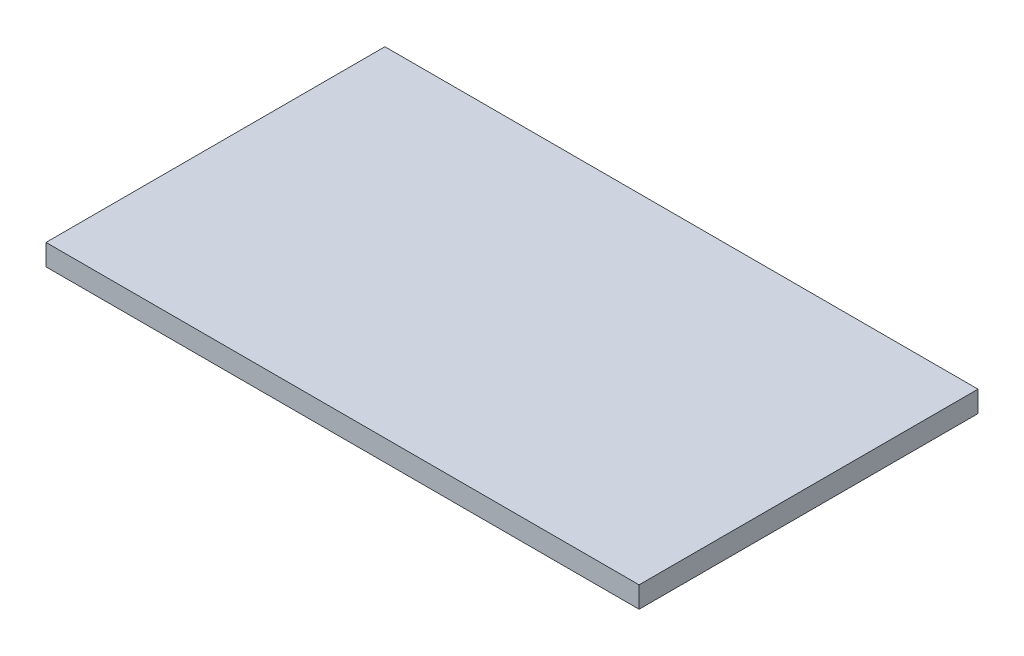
from build123d import *

# Parameters (mm, degrees)
ESTRUSIONE_ESTRUSIONE1_DEPTH      = 800
ESTRUSIONE_ESTRUSIONE1_DEPTH_BACK = 800
SCHIZZO1_W                        = 2800
SCHIZZO1_H                        = 100


with BuildPart() as part:
    # Schizzo1 → Estrusione-Estrusione1 (new, two sides: drawn at the far end of the back side and taken through both)
    with BuildSketch(Plane.XY.offset(-ESTRUSIONE_ESTRUSIONE1_DEPTH_BACK)):
        with Locations((1400, 50)):
            Rectangle(SCHIZZO1_W, SCHIZZO1_H)
    extrude(amount=ESTRUSIONE_ESTRUSIONE1_DEPTH + ESTRUSIONE_ESTRUSIONE1_DEPTH_BACK)


solid = part.part
